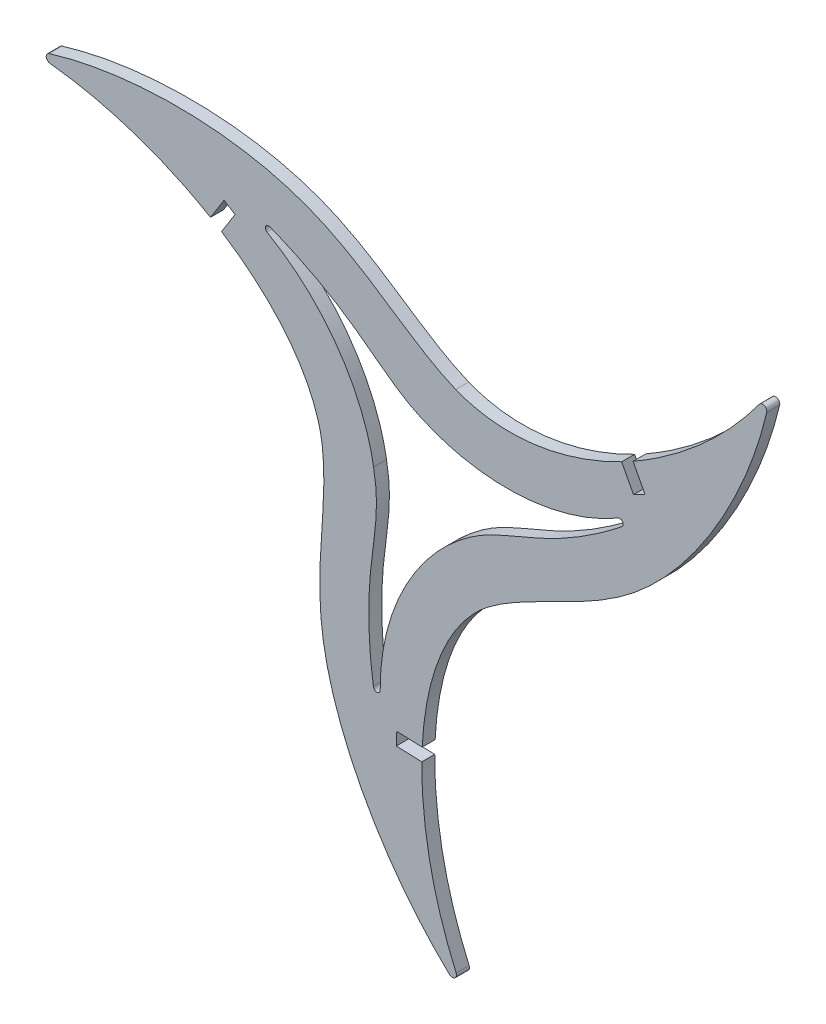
ISO-10303-21;
HEADER;
FILE_DESCRIPTION(('STEP AP214'),'2;1');
FILE_NAME('part.step','',(''),(''),'','','');
FILE_SCHEMA(('AUTOMOTIVE_DESIGN { 1 0 10303 214 1 1 1 1 }'));
ENDSEC;
DATA;
#1=APPLICATION_CONTEXT('core data for automotive mechanical design processes');
#2=APPLICATION_PROTOCOL_DEFINITION('international standard','automotive_design',2000,#1);
#3=PRODUCT_CONTEXT('',#1,'mechanical');
#4=PRODUCT('Part','Part','',(#3));
#5=PRODUCT_RELATED_PRODUCT_CATEGORY('part','',(#4));
#6=PRODUCT_DEFINITION_FORMATION('','',#4);
#7=PRODUCT_DEFINITION_CONTEXT('part definition',#1,'design');
#8=PRODUCT_DEFINITION('design','',#6,#7);
#9=PRODUCT_DEFINITION_SHAPE('','',#8);
#10=(LENGTH_UNIT() NAMED_UNIT(*) SI_UNIT(.MILLI.,.METRE.));
#11=(NAMED_UNIT(*) PLANE_ANGLE_UNIT() SI_UNIT($,.RADIAN.));
#12=(NAMED_UNIT(*) SI_UNIT($,.STERADIAN.) SOLID_ANGLE_UNIT());
#13=UNCERTAINTY_MEASURE_WITH_UNIT(LENGTH_MEASURE(1.E-05),#10,'distance_accuracy_value','');
#14=(GEOMETRIC_REPRESENTATION_CONTEXT(3) GLOBAL_UNCERTAINTY_ASSIGNED_CONTEXT((#13)) GLOBAL_UNIT_ASSIGNED_CONTEXT((#10,
#11,#12)) REPRESENTATION_CONTEXT('',''));
#15=CARTESIAN_POINT('',(0.,0.,0.));
#16=DIRECTION('',(0.,0.,1.));
#17=DIRECTION('',(1.,0.,0.));
#18=AXIS2_PLACEMENT_3D('',#15,#16,#17);
#19=CARTESIAN_POINT('',(-6.52877190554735,-77.4366756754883,1.5875));
#20=DIRECTION('',(0.,0.,-1.));
#21=DIRECTION('',(-1.,0.,0.));
#22=AXIS2_PLACEMENT_3D('',#19,#20,#21);
#23=PLANE('',#22);
#24=DIRECTION('',(0.0387510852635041,0.999248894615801,0.));
#25=VECTOR('',#24,1.);
#26=CARTESIAN_POINT('',(-14.7313340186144,-53.2800894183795,1.5875));
#27=LINE('',#26,#25);
#28=CARTESIAN_POINT('',(-14.8543686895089,-56.45270401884,1.5875));
#29=VERTEX_POINT('',#28);
#30=CARTESIAN_POINT('',(-14.7313340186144,-53.2800894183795,1.5875));
#31=VERTEX_POINT('',#30);
#32=EDGE_CURVE('E479',#29,#31,#27,.T.);
#33=ORIENTED_EDGE('',*,*,#32,.T.);
#34=DIRECTION('',(0.999248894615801,-0.0387510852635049,0.));
#35=VECTOR('',#34,1.);
#36=CARTESIAN_POINT('',(-8.50623298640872,-53.5215001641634,1.5875));
#37=LINE('',#36,#35);
#38=CARTESIAN_POINT('',(-8.50623298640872,-53.5215001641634,1.5875));
#39=VERTEX_POINT('',#38);
#40=EDGE_CURVE('E639',#31,#39,#37,.T.);
#41=ORIENTED_EDGE('',*,*,#40,.T.);
#42=CARTESIAN_POINT('',(-8.50623298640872,-53.5215001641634,1.5875));
#43=CARTESIAN_POINT('',(-7.73523017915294,-37.7848240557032,1.5875));
#44=CARTESIAN_POINT('',(-2.57423755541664,-23.7642628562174,1.5875));
#45=CARTESIAN_POINT('',(7.511092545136,-15.8019659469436,1.5875));
#46=B_SPLINE_CURVE_WITH_KNOTS('',3,(#42,#43,#44,#45),.UNSPECIFIED.,.F.,.F.,(4,4),
(-4.87225398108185,-4.37353785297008),.UNSPECIFIED.);
#47=CARTESIAN_POINT('',(7.511092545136,-15.8019659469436,1.5875));
#48=VERTEX_POINT('',#47);
#49=EDGE_CURVE('E542',#39,#48,#46,.T.);
#50=ORIENTED_EDGE('',*,*,#49,.T.);
#51=CARTESIAN_POINT('',(7.511092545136,-15.8019659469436,1.5875));
#52=CARTESIAN_POINT('',(17.4510254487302,-8.16564504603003,1.5875));
#53=CARTESIAN_POINT('',(47.9124311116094,-0.35037258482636,1.5875));
#54=CARTESIAN_POINT('',(71.0416382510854,38.7823587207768,1.5875));
#55=CARTESIAN_POINT('',(75.951434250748,59.766885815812,1.5875));
#56=B_SPLINE_CURVE_WITH_KNOTS('',3,(#51,#52,#53,#54,#55),.UNSPECIFIED.,.F.,.F.,(4,1,4),
(-9.32417803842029,-7.32774650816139,-4.87225398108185),.UNSPECIFIED.);
#57=CARTESIAN_POINT('',(75.951434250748,59.766885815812,1.5875));
#58=VERTEX_POINT('',#57);
#59=EDGE_CURVE('E560',#48,#58,#56,.T.);
#60=ORIENTED_EDGE('',*,*,#59,.T.);
#61=CARTESIAN_POINT('',(75.951434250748,59.766885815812,1.5875));
#62=CARTESIAN_POINT('',(76.1405251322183,60.5750625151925,1.5875));
#63=CARTESIAN_POINT('',(75.3863139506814,60.9215743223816,1.5875));
#64=(BOUNDED_CURVE() B_SPLINE_CURVE(2,(#61,#62,#63),.UNSPECIFIED.,.F.,
.F.) B_SPLINE_CURVE_WITH_KNOTS((3,3),(0.,0.0547984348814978),
.UNSPECIFIED.) CURVE() GEOMETRIC_REPRESENTATION_ITEM() RATIONAL_B_SPLINE_CURVE((1.,
0.774431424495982,1.)) REPRESENTATION_ITEM(''));
#65=CARTESIAN_POINT('',(75.3863139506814,60.9215743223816,1.5875));
#66=VERTEX_POINT('',#65);
#67=EDGE_CURVE('E557',#58,#66,#64,.T.);
#68=ORIENTED_EDGE('',*,*,#67,.T.);
#69=CARTESIAN_POINT('',(75.3863139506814,60.9215743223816,1.5875));
#70=CARTESIAN_POINT('',(74.632102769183,61.2680861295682,1.5875));
#71=CARTESIAN_POINT('',(74.1420996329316,60.5981593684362,1.5875));
#72=(BOUNDED_CURVE() B_SPLINE_CURVE(2,(#69,#70,#71),.UNSPECIFIED.,.F.,
.F.) B_SPLINE_CURVE_WITH_KNOTS((3,3),(0.,0.0547984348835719),
.UNSPECIFIED.) CURVE() GEOMETRIC_REPRESENTATION_ITEM() RATIONAL_B_SPLINE_CURVE((1.,
0.774431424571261,1.)) REPRESENTATION_ITEM(''));
#73=CARTESIAN_POINT('',(74.1420996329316,60.5981593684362,1.5875));
#74=VERTEX_POINT('',#73);
#75=EDGE_CURVE('E559',#66,#74,#72,.T.);
#76=ORIENTED_EDGE('',*,*,#75,.T.);
#77=CARTESIAN_POINT('',(74.1420996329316,60.5981593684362,1.5875));
#78=CARTESIAN_POINT('',(61.5985868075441,43.5147010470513,1.5875));
#79=CARTESIAN_POINT('',(43.1901504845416,33.0116665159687,1.5875));
#80=(BOUNDED_CURVE() B_SPLINE_CURVE(2,(#77,#78,#79),.UNSPECIFIED.,.F.,
.F.) B_SPLINE_CURVE_WITH_KNOTS((3,3),(0.,1.6443338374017),
.UNSPECIFIED.) CURVE() GEOMETRIC_REPRESENTATION_ITEM() RATIONAL_B_SPLINE_CURVE((1.,
0.978138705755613,1.)) REPRESENTATION_ITEM(''));
#81=CARTESIAN_POINT('',(43.1901504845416,33.0116665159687,1.5875));
#82=VERTEX_POINT('',#81);
#83=EDGE_CURVE('E562',#74,#82,#80,.T.);
#84=ORIENTED_EDGE('',*,*,#83,.T.);
#85=DIRECTION('',(0.466065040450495,-0.884750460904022,0.));
#86=VECTOR('',#85,1.);
#87=CARTESIAN_POINT('',(43.1901504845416,33.0116665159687,1.5875));
#88=LINE('',#87,#86);
#89=CARTESIAN_POINT('',(46.1062979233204,27.4758237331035,1.5875));
#90=VERTEX_POINT('',#89);
#91=EDGE_CURVE('E583',#82,#90,#88,.T.);
#92=ORIENTED_EDGE('',*,*,#91,.T.);
#93=DIRECTION('',(-0.884750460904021,-0.466065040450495,0.));
#94=VECTOR('',#93,1.);
#95=CARTESIAN_POINT('',(43.2972156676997,25.9960674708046,1.5875));
#96=LINE('',#95,#94);
#97=CARTESIAN_POINT('',(43.2972156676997,25.9960674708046,1.5875));
#98=VERTEX_POINT('',#97);
#99=EDGE_CURVE('E588',#90,#98,#96,.T.);
#100=ORIENTED_EDGE('',*,*,#99,.T.);
#101=DIRECTION('',(-0.466065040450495,0.884750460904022,0.));
#102=VECTOR('',#101,1.);
#103=CARTESIAN_POINT('',(40.3937328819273,31.5078684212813,1.5875));
#104=LINE('',#103,#102);
#105=CARTESIAN_POINT('',(40.3937328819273,31.5078684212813,1.5875));
#106=VERTEX_POINT('',#105);
#107=EDGE_CURVE('E590',#98,#106,#104,.T.);
#108=ORIENTED_EDGE('',*,*,#107,.T.);
#109=CARTESIAN_POINT('',(40.3937328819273,31.5078684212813,1.5875));
#110=CARTESIAN_POINT('',(26.3798701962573,24.3072383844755,1.5875));
#111=CARTESIAN_POINT('',(11.65721170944,21.7665085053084,1.5875));
#112=CARTESIAN_POINT('',(-0.281004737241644,26.5195121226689,1.5875));
#113=B_SPLINE_CURVE_WITH_KNOTS('',3,(#109,#110,#111,#112),.UNSPECIFIED.,.F.,.F.,(4,4),
(-10.9676672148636,-10.4689510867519),.UNSPECIFIED.);
#114=CARTESIAN_POINT('',(-0.281004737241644,26.5195121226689,1.5875));
#115=VERTEX_POINT('',#114);
#116=EDGE_CURVE('E592',#106,#115,#113,.T.);
#117=ORIENTED_EDGE('',*,*,#116,.T.);
#118=CARTESIAN_POINT('',(-0.281004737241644,26.5195121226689,1.5875));
#119=CARTESIAN_POINT('',(-11.8642190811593,31.3095860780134,1.5875));
#120=CARTESIAN_POINT('',(-33.8631464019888,53.782300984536,1.5875));
#121=CARTESIAN_POINT('',(-79.3176894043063,54.2464162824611,1.5875));
#122=CARTESIAN_POINT('',(-99.9457209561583,48.0061607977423,1.5875));
#123=B_SPLINE_CURVE_WITH_KNOTS('',3,(#118,#119,#120,#121,#122),.UNSPECIFIED.,.F.,.F.,(4,1,4),
(-15.4195912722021,-13.4231597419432,-10.9676672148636),.UNSPECIFIED.);
#124=CARTESIAN_POINT('',(-99.9457209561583,48.0061607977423,1.5875));
#125=VERTEX_POINT('',#124);
#126=EDGE_CURVE('E597',#115,#125,#123,.T.);
#127=ORIENTED_EDGE('',*,*,#126,.T.);
#128=CARTESIAN_POINT('',(-99.9457209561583,48.0061607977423,1.5875));
#129=CARTESIAN_POINT('',(-100.740167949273,47.765829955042,1.5875));
#130=CARTESIAN_POINT('',(-100.663150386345,46.9394080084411,1.5875));
#131=(BOUNDED_CURVE() B_SPLINE_CURVE(2,(#128,#129,#130),.UNSPECIFIED.,.F.,
.F.) B_SPLINE_CURVE_WITH_KNOTS((3,3),(0.,0.0547984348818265),
.UNSPECIFIED.) CURVE() GEOMETRIC_REPRESENTATION_ITEM() RATIONAL_B_SPLINE_CURVE((1.,
0.774431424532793,1.)) REPRESENTATION_ITEM(''));
#132=CARTESIAN_POINT('',(-100.663150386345,46.9394080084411,1.5875));
#133=VERTEX_POINT('',#132);
#134=EDGE_CURVE('E1063',#125,#133,#131,.T.);
#135=ORIENTED_EDGE('',*,*,#134,.T.);
#136=CARTESIAN_POINT('',(-100.663150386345,46.9394080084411,1.5875));
#137=CARTESIAN_POINT('',(-100.586132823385,46.1129860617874,1.5875));
#138=CARTESIAN_POINT('',(-99.7609576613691,46.0235942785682,1.5875));
#139=(BOUNDED_CURVE() B_SPLINE_CURVE(2,(#136,#137,#138),.UNSPECIFIED.,.F.,
.F.) B_SPLINE_CURVE_WITH_KNOTS((3,3),(0.,0.0547984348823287),
.UNSPECIFIED.) CURVE() GEOMETRIC_REPRESENTATION_ITEM() RATIONAL_B_SPLINE_CURVE((1.,
0.774431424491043,1.)) REPRESENTATION_ITEM(''));
#140=CARTESIAN_POINT('',(-99.7609576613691,46.0235942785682,1.5875));
#141=VERTEX_POINT('',#140);
#142=EDGE_CURVE('E1080',#133,#141,#139,.T.);
#143=ORIENTED_EDGE('',*,*,#142,.T.);
#144=CARTESIAN_POINT('',(-99.7609576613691,46.0235942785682,1.5875));
#145=CARTESIAN_POINT('',(-78.6944923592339,43.7023226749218,1.5875));
#146=CARTESIAN_POINT('',(-60.3943794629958,33.0116664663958,1.5875));
#147=(BOUNDED_CURVE() B_SPLINE_CURVE(2,(#144,#145,#146),.UNSPECIFIED.,.F.,
.F.) B_SPLINE_CURVE_WITH_KNOTS((3,3),(0.,1.64433383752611),
.UNSPECIFIED.) CURVE() GEOMETRIC_REPRESENTATION_ITEM() RATIONAL_B_SPLINE_CURVE((1.,
0.978138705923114,1.)) REPRESENTATION_ITEM(''));
#148=CARTESIAN_POINT('',(-60.3943794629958,33.0116664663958,1.5875));
#149=VERTEX_POINT('',#148);
#150=EDGE_CURVE('E1055',#141,#149,#147,.T.);
#151=ORIENTED_EDGE('',*,*,#150,.T.);
#152=DIRECTION('',(0.53318384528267,0.845999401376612,0.));
#153=VECTOR('',#152,1.);
#154=CARTESIAN_POINT('',(-60.3943794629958,33.0116664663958,1.5875));
#155=LINE('',#154,#153);
#156=CARTESIAN_POINT('',(-57.0582727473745,38.3050456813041,1.5875));
#157=VERTEX_POINT('',#156);
#158=EDGE_CURVE('E1052',#149,#157,#155,.T.);
#159=ORIENTED_EDGE('',*,*,#158,.T.);
#160=DIRECTION('',(0.845999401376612,-0.533183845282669,0.));
#161=VECTOR('',#160,1.);
#162=CARTESIAN_POINT('',(-57.0582727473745,38.3050456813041,1.5875));
#163=LINE('',#162,#161);
#164=CARTESIAN_POINT('',(-54.3722251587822,36.6121872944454,1.5875));
#165=VERTEX_POINT('',#164);
#166=EDGE_CURVE('E1050',#157,#165,#163,.T.);
#167=ORIENTED_EDGE('',*,*,#166,.T.);
#168=DIRECTION('',(-0.533183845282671,-0.845999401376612,0.));
#169=VECTOR('',#168,1.);
#170=CARTESIAN_POINT('',(-57.6938433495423,31.3417969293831,1.5875));
#171=LINE('',#170,#169);
#172=CARTESIAN_POINT('',(-57.6938433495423,31.3417969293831,1.5875));
#173=VERTEX_POINT('',#172);
#174=EDGE_CURVE('E1042',#165,#173,#171,.T.);
#175=ORIENTED_EDGE('',*,*,#174,.T.);
#176=CARTESIAN_POINT('',(-57.6938433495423,31.3417969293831,1.5875));
#177=CARTESIAN_POINT('',(-44.4509834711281,22.8057508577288,1.5875));
#178=CARTESIAN_POINT('',(-34.8893176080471,11.3259195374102,1.5875));
#179=CARTESIAN_POINT('',(-33.0364312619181,-1.38938098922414,1.5875));
#180=B_SPLINE_CURVE_WITH_KNOTS('',3,(#176,#177,#178,#179),.UNSPECIFIED.,.F.,.F.,(4,4),
(-17.0630804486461,-16.5643643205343),.UNSPECIFIED.);
#181=CARTESIAN_POINT('',(-33.0364312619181,-1.38938098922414,1.5875));
#182=VERTEX_POINT('',#181);
#183=EDGE_CURVE('E325',#173,#182,#180,.T.);
#184=ORIENTED_EDGE('',*,*,#183,.T.);
#185=CARTESIAN_POINT('',(-33.0364312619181,-1.38938098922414,1.5875));
#186=CARTESIAN_POINT('',(-31.3931498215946,-13.8157758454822,1.5875));
#187=CARTESIAN_POINT('',(-39.8556281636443,-44.1037632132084,1.5875));
#188=CARTESIAN_POINT('',(-17.5302923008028,-83.7006098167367,1.5875));
#189=CARTESIAN_POINT('',(-1.81205674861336,-98.4448814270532,1.5875));
#190=B_SPLINE_CURVE_WITH_KNOTS('',3,(#185,#186,#187,#188,#189),.UNSPECIFIED.,.F.,.F.,(4,1,4),
(-21.5150045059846,-19.5185729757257,-17.0630804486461),.UNSPECIFIED.);
#191=CARTESIAN_POINT('',(-1.81205674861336,-98.4448814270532,1.5875));
#192=VERTEX_POINT('',#191);
#193=EDGE_CURVE('E319',#182,#192,#190,.T.);
#194=ORIENTED_EDGE('',*,*,#193,.T.);
#195=CARTESIAN_POINT('',(-1.81205674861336,-98.4448814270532,1.5875));
#196=CARTESIAN_POINT('',(-1.20670063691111,-99.0127272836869,1.5875));
#197=CARTESIAN_POINT('',(-0.529507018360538,-98.5328171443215,1.5875));
#198=(BOUNDED_CURVE() B_SPLINE_CURVE(2,(#195,#196,#197),.UNSPECIFIED.,.F.,
.F.) B_SPLINE_CURVE_WITH_KNOTS((3,3),(0.,0.0547984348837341),
.UNSPECIFIED.) CURVE() GEOMETRIC_REPRESENTATION_ITEM() RATIONAL_B_SPLINE_CURVE((1.,
0.774431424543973,1.)) REPRESENTATION_ITEM(''));
#199=CARTESIAN_POINT('',(-0.529507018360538,-98.5328171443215,1.5875));
#200=VERTEX_POINT('',#199);
#201=EDGE_CURVE('E324',#192,#200,#198,.T.);
#202=ORIENTED_EDGE('',*,*,#201,.T.);
#203=CARTESIAN_POINT('',(-0.529507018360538,-98.5328171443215,1.5875));
#204=CARTESIAN_POINT('',(0.147686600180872,-98.0529070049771,1.5875));
#205=CARTESIAN_POINT('',(-0.187485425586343,-97.2935884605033,1.5875));
#206=(BOUNDED_CURVE() B_SPLINE_CURVE(2,(#203,#204,#205),.UNSPECIFIED.,.F.,
.F.) B_SPLINE_CURVE_WITH_KNOTS((3,3),(0.,0.0547984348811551),
.UNSPECIFIED.) CURVE() GEOMETRIC_REPRESENTATION_ITEM() RATIONAL_B_SPLINE_CURVE((1.,
0.77443142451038,1.)) REPRESENTATION_ITEM(''));
#207=CARTESIAN_POINT('',(-0.187485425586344,-97.2935884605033,1.5875));
#208=VERTEX_POINT('',#207);
#209=EDGE_CURVE('E336',#200,#208,#206,.T.);
#210=ORIENTED_EDGE('',*,*,#209,.T.);
#211=CARTESIAN_POINT('',(-0.187485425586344,-97.2935884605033,1.5875));
#212=CARTESIAN_POINT('',(-8.71043790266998,-77.8888585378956,1.5875));
#213=CARTESIAN_POINT('',(-8.60211447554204,-56.6951677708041,1.5875));
#214=(BOUNDED_CURVE() B_SPLINE_CURVE(2,(#211,#212,#213),.UNSPECIFIED.,.F.,
.F.) B_SPLINE_CURVE_WITH_KNOTS((3,3),(0.,1.64433383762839),
.UNSPECIFIED.) CURVE() GEOMETRIC_REPRESENTATION_ITEM() RATIONAL_B_SPLINE_CURVE((1.,
0.978138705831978,1.)) REPRESENTATION_ITEM(''));
#215=CARTESIAN_POINT('',(-8.60211447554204,-56.6951677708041,1.5875));
#216=VERTEX_POINT('',#215);
#217=EDGE_CURVE('E343',#208,#216,#214,.T.);
#218=ORIENTED_EDGE('',*,*,#217,.T.);
#219=DIRECTION('',(-0.999248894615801,0.0387510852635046,0.));
#220=VECTOR('',#219,1.);
#221=CARTESIAN_POINT('',(-8.60211447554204,-56.6951677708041,1.5875));
#222=LINE('',#221,#220);
#223=EDGE_CURVE('E350',#216,#29,#222,.T.);
#224=ORIENTED_EDGE('',*,*,#223,.T.);
#225=EDGE_LOOP('',(#33,#41,#50,#60,#68,#76,#84,#92,#100,#108,#117,#127,#135,#143,#151,#159,#167,
#175,#184,#194,#202,#210,#218,#224));
#226=FACE_BOUND('',#225,.T.);
#227=CARTESIAN_POINT('',(39.5662535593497,19.140152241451,1.5875));
#228=CARTESIAN_POINT('',(31.4491730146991,14.4156186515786,1.5875));
#229=CARTESIAN_POINT('',(14.5864923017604,10.2111099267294,1.5875));
#230=CARTESIAN_POINT('',(0.388470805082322,12.7486333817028,1.5875));
#231=CARTESIAN_POINT('',(-5.38561901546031,14.899299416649,1.5875));
#232=B_SPLINE_CURVE_WITH_KNOTS('',3,(#227,#228,#229,#230,#231),.UNSPECIFIED.,.F.,.F.,(4,1,4),
(6.03674102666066,6.50552735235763,6.97431367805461),.UNSPECIFIED.);
#233=CARTESIAN_POINT('',(39.5662535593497,19.140152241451,1.5875));
#234=VERTEX_POINT('',#233);
#235=CARTESIAN_POINT('',(-5.38561901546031,14.899299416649,1.5875));
#236=VERTEX_POINT('',#235);
#237=EDGE_CURVE('E246',#234,#236,#232,.T.);
#238=ORIENTED_EDGE('',*,*,#237,.F.);
#239=CARTESIAN_POINT('',(40.3442140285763,17.6671163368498,1.5875));
#240=CARTESIAN_POINT('',(40.5017514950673,17.7911972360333,1.5875));
#241=CARTESIAN_POINT('',(41.3286632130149,18.4429762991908,1.5875));
#242=CARTESIAN_POINT('',(40.8017205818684,19.5873427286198,1.5875));
#243=CARTESIAN_POINT('',(39.7004339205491,19.218251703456,1.5875));
#244=CARTESIAN_POINT('',(39.5662535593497,19.140152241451,1.5875));
#245=B_SPLINE_CURVE_WITH_KNOTS('',5,(#239,#240,#241,#242,#243,#244),.UNSPECIFIED.,.F.,.F.,(6,6),
(5.03674102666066,6.03674102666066),.UNSPECIFIED.);
#246=CARTESIAN_POINT('',(40.3442140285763,17.6671163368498,1.5875));
#247=VERTEX_POINT('',#246);
#248=EDGE_CURVE('E659',#247,#234,#245,.T.);
#249=ORIENTED_EDGE('',*,*,#248,.F.);
#250=CARTESIAN_POINT('',(0.,-5.5711336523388,1.5875));
#251=CARTESIAN_POINT('',(0.820505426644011,-4.90757564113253,1.5875));
#252=CARTESIAN_POINT('',(11.4383852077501,3.76167451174,1.5875));
#253=CARTESIAN_POINT('',(21.5554192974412,2.86853796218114,1.5875));
#254=CARTESIAN_POINT('',(40.3442140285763,17.6671163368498,1.5875));
#255=B_SPLINE_CURVE_WITH_KNOTS('',3,(#250,#251,#252,#253,#254),.UNSPECIFIED.,.F.,.F.,(4,1,4),
(3.95594316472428,4.03674102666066,5.03674102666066),.UNSPECIFIED.);
#256=CARTESIAN_POINT('',(0.,-5.5711336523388,1.5875));
#257=VERTEX_POINT('',#256);
#258=EDGE_CURVE('E731',#257,#247,#255,.T.);
#259=ORIENTED_EDGE('',*,*,#258,.F.);
#260=CARTESIAN_POINT('',(-18.8032500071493,-46.6210236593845,1.5875));
#261=CARTESIAN_POINT('',(-18.8362758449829,-37.229158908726,1.5875));
#262=CARTESIAN_POINT('',(-14.0461468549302,-20.5233946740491,1.5875));
#263=CARTESIAN_POINT('',(-4.74957633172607,-9.49630910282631,1.5875));
#264=CARTESIAN_POINT('',(0.,-5.5711336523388,1.5875));
#265=B_SPLINE_CURVE_WITH_KNOTS('',3,(#260,#261,#262,#263,#264),.UNSPECIFIED.,.F.,.F.,(4,1,4),
(3.01837051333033,3.4871568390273,3.95594316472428),.UNSPECIFIED.);
#266=CARTESIAN_POINT('',(-18.8032500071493,-46.6210236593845,1.5875));
#267=VERTEX_POINT('',#266);
#268=EDGE_CURVE('E754',#267,#257,#265,.T.);
#269=ORIENTED_EDGE('',*,*,#268,.F.);
#270=CARTESIAN_POINT('',(-20.4679167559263,-46.5582392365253,1.5875));
#271=CARTESIAN_POINT('',(-20.4392282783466,-46.7567111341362,1.5875));
#272=CARTESIAN_POINT('',(-20.2882269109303,-47.7987272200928,1.5875));
#273=CARTESIAN_POINT('',(-19.0337051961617,-47.9145647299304,1.5875));
#274=CARTESIAN_POINT('',(-18.8027040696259,-46.7762769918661,1.5875));
#275=CARTESIAN_POINT('',(-18.8032500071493,-46.6210236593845,1.5875));
#276=B_SPLINE_CURVE_WITH_KNOTS('',5,(#270,#271,#272,#273,#274,#275),.UNSPECIFIED.,.F.,.F.,(6,6),
(2.01837051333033,3.01837051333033),.UNSPECIFIED.);
#277=CARTESIAN_POINT('',(-20.4679167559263,-46.5582392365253,1.5875));
#278=VERTEX_POINT('',#277);
#279=EDGE_CURVE('E758',#278,#267,#276,.T.);
#280=ORIENTED_EDGE('',*,*,#279,.F.);
#281=CARTESIAN_POINT('',(-20.4207245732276,0.,1.5875));
#282=CARTESIAN_POINT('',(-20.2563191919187,-1.04235754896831,1.5875));
#283=CARTESIAN_POINT('',(-18.0574682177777,-14.5723362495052,1.5875));
#284=CARTESIAN_POINT('',(-23.8894642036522,-22.8873765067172,1.5875));
#285=CARTESIAN_POINT('',(-20.4679167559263,-46.5582392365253,1.5875));
#286=B_SPLINE_CURVE_WITH_KNOTS('',3,(#281,#282,#283,#284,#285),.UNSPECIFIED.,.F.,.F.,(4,1,4),
(0.93757265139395,1.01837051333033,2.01837051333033),.UNSPECIFIED.);
#287=CARTESIAN_POINT('',(-20.4207245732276,0.,1.5875));
#288=VERTEX_POINT('',#287);
#289=EDGE_CURVE('E766',#288,#278,#286,.T.);
#290=ORIENTED_EDGE('',*,*,#289,.F.);
#291=CARTESIAN_POINT('',(-46.5693471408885,36.8090371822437,1.5875));
#292=CARTESIAN_POINT('',(-38.4192407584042,32.1417060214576,1.5875));
#293=CARTESIAN_POINT('',(-26.3466890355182,19.6404505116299,1.5875));
#294=CARTESIAN_POINT('',(-21.4452380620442,6.07584148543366,1.5875));
#295=CARTESIAN_POINT('',(-20.4207245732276,0.,1.5875));
#296=B_SPLINE_CURVE_WITH_KNOTS('',3,(#291,#292,#293,#294,#295),.UNSPECIFIED.,.F.,.F.,(4,1,4),
(0.,0.468786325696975,0.93757265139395),.UNSPECIFIED.);
#297=CARTESIAN_POINT('',(-46.5693471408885,36.8090371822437,1.5875));
#298=VERTEX_POINT('',#297);
#299=EDGE_CURVE('E269',#298,#288,#296,.T.);
#300=ORIENTED_EDGE('',*,*,#299,.F.);
#301=CARTESIAN_POINT('',(-45.682640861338,38.2192886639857,1.5875));
#302=CARTESIAN_POINT('',(-45.8688668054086,38.2936796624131,1.5875));
#303=CARTESIAN_POINT('',(-46.8467798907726,38.6839166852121,1.5875));
#304=CARTESIAN_POINT('',(-47.5743589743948,37.6553877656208,1.5875));
#305=CARTESIAN_POINT('',(-46.7040734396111,36.8861910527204,1.5875));
#306=CARTESIAN_POINT('',(-46.5693471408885,36.8090371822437,1.5875));
#307=B_SPLINE_CURVE_WITH_KNOTS('',5,(#301,#302,#303,#304,#305,#306),.UNSPECIFIED.,.F.,.F.,(6,6),
(-1.,0.),.UNSPECIFIED.);
#308=CARTESIAN_POINT('',(-45.682640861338,38.2192886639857,1.5875));
#309=VERTEX_POINT('',#308);
#310=EDGE_CURVE('E267',#309,#298,#307,.T.);
#311=ORIENTED_EDGE('',*,*,#310,.F.);
#312=CARTESIAN_POINT('',(-5.38561901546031,14.899299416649,1.5875));
#313=CARTESIAN_POINT('',(-6.37052982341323,15.2780989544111,1.5875));
#314=CARTESIAN_POINT('',(-19.1872605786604,20.1388275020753,1.5875));
#315=CARTESIAN_POINT('',(-23.4722986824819,29.3470043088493,1.5875));
#316=CARTESIAN_POINT('',(-45.682640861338,38.2192886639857,1.5875));
#317=B_SPLINE_CURVE_WITH_KNOTS('',3,(#312,#313,#314,#315,#316),.UNSPECIFIED.,.F.,.F.,(4,1,4),
(6.97431367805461,7.05511153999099,8.05511153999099),.UNSPECIFIED.);
#318=EDGE_CURVE('E254',#236,#309,#317,.T.);
#319=ORIENTED_EDGE('',*,*,#318,.F.);
#320=EDGE_LOOP('',(#238,#249,#259,#269,#280,#290,#300,#311,#319));
#321=FACE_BOUND('',#320,.T.);
#322=ADVANCED_FACE('F31',(#226,#321),#23,.F.);
#323=CARTESIAN_POINT('',(-6.52877190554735,-77.4366756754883,-1.5875));
#324=DIRECTION('',(0.,0.,-1.));
#325=DIRECTION('',(-1.,0.,0.));
#326=AXIS2_PLACEMENT_3D('',#323,#324,#325);
#327=PLANE('',#326);
#328=DIRECTION('',(0.0387510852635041,0.999248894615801,0.));
#329=VECTOR('',#328,1.);
#330=CARTESIAN_POINT('',(-14.7313340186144,-53.2800894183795,-1.5875));
#331=LINE('',#330,#329);
#332=CARTESIAN_POINT('',(-14.8543686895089,-56.45270401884,-1.5875));
#333=VERTEX_POINT('',#332);
#334=CARTESIAN_POINT('',(-14.7313340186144,-53.2800894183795,-1.5875));
#335=VERTEX_POINT('',#334);
#336=EDGE_CURVE('E262',#333,#335,#331,.T.);
#337=ORIENTED_EDGE('',*,*,#336,.F.);
#338=DIRECTION('',(-0.999248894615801,0.0387510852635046,0.));
#339=VECTOR('',#338,1.);
#340=CARTESIAN_POINT('',(-8.60211447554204,-56.6951677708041,-1.5875));
#341=LINE('',#340,#339);
#342=CARTESIAN_POINT('',(-8.60211447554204,-56.6951677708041,-1.5875));
#343=VERTEX_POINT('',#342);
#344=EDGE_CURVE('E474',#343,#333,#341,.T.);
#345=ORIENTED_EDGE('',*,*,#344,.F.);
#346=CARTESIAN_POINT('',(-0.187485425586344,-97.2935884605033,-1.5875));
#347=CARTESIAN_POINT('',(-8.71043790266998,-77.8888585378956,-1.5875));
#348=CARTESIAN_POINT('',(-8.60211447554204,-56.6951677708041,-1.5875));
#349=(BOUNDED_CURVE() B_SPLINE_CURVE(2,(#346,#347,#348),.UNSPECIFIED.,.F.,
.F.) B_SPLINE_CURVE_WITH_KNOTS((3,3),(0.,1.64433383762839),
.UNSPECIFIED.) CURVE() GEOMETRIC_REPRESENTATION_ITEM() RATIONAL_B_SPLINE_CURVE((1.,
0.978138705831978,1.)) REPRESENTATION_ITEM(''));
#350=CARTESIAN_POINT('',(-0.187485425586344,-97.2935884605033,-1.5875));
#351=VERTEX_POINT('',#350);
#352=EDGE_CURVE('E467',#351,#343,#349,.T.);
#353=ORIENTED_EDGE('',*,*,#352,.F.);
#354=CARTESIAN_POINT('',(-0.529507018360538,-98.5328171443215,-1.5875));
#355=CARTESIAN_POINT('',(0.147686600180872,-98.0529070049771,-1.5875));
#356=CARTESIAN_POINT('',(-0.187485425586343,-97.2935884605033,-1.5875));
#357=(BOUNDED_CURVE() B_SPLINE_CURVE(2,(#354,#355,#356),.UNSPECIFIED.,.F.,
.F.) B_SPLINE_CURVE_WITH_KNOTS((3,3),(0.,0.0547984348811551),
.UNSPECIFIED.) CURVE() GEOMETRIC_REPRESENTATION_ITEM() RATIONAL_B_SPLINE_CURVE((1.,
0.77443142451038,1.)) REPRESENTATION_ITEM(''));
#358=CARTESIAN_POINT('',(-0.529507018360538,-98.5328171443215,-1.5875));
#359=VERTEX_POINT('',#358);
#360=EDGE_CURVE('E460',#359,#351,#357,.T.);
#361=ORIENTED_EDGE('',*,*,#360,.F.);
#362=CARTESIAN_POINT('',(-1.81205674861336,-98.4448814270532,-1.5875));
#363=CARTESIAN_POINT('',(-1.20670063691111,-99.0127272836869,-1.5875));
#364=CARTESIAN_POINT('',(-0.529507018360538,-98.5328171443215,-1.5875));
#365=(BOUNDED_CURVE() B_SPLINE_CURVE(2,(#362,#363,#364),.UNSPECIFIED.,.F.,
.F.) B_SPLINE_CURVE_WITH_KNOTS((3,3),(0.,0.0547984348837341),
.UNSPECIFIED.) CURVE() GEOMETRIC_REPRESENTATION_ITEM() RATIONAL_B_SPLINE_CURVE((1.,
0.774431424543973,1.)) REPRESENTATION_ITEM(''));
#366=CARTESIAN_POINT('',(-1.81205674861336,-98.4448814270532,-1.5875));
#367=VERTEX_POINT('',#366);
#368=EDGE_CURVE('E453',#367,#359,#365,.T.);
#369=ORIENTED_EDGE('',*,*,#368,.F.);
#370=CARTESIAN_POINT('',(-33.0364312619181,-1.38938098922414,-1.5875));
#371=CARTESIAN_POINT('',(-31.3931498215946,-13.8157758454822,-1.5875));
#372=CARTESIAN_POINT('',(-39.8556281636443,-44.1037632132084,-1.5875));
#373=CARTESIAN_POINT('',(-17.5302923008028,-83.7006098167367,-1.5875));
#374=CARTESIAN_POINT('',(-1.81205674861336,-98.4448814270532,-1.5875));
#375=B_SPLINE_CURVE_WITH_KNOTS('',3,(#370,#371,#372,#373,#374),.UNSPECIFIED.,.F.,.F.,(4,1,4),
(-21.5150045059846,-19.5185729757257,-17.0630804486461),.UNSPECIFIED.);
#376=CARTESIAN_POINT('',(-33.0364312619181,-1.38938098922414,-1.5875));
#377=VERTEX_POINT('',#376);
#378=EDGE_CURVE('E446',#377,#367,#375,.T.);
#379=ORIENTED_EDGE('',*,*,#378,.F.);
#380=CARTESIAN_POINT('',(-57.6938433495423,31.3417969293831,-1.5875));
#381=CARTESIAN_POINT('',(-44.4509834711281,22.8057508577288,-1.5875));
#382=CARTESIAN_POINT('',(-34.8893176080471,11.3259195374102,-1.5875));
#383=CARTESIAN_POINT('',(-33.0364312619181,-1.38938098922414,-1.5875));
#384=B_SPLINE_CURVE_WITH_KNOTS('',3,(#380,#381,#382,#383),.UNSPECIFIED.,.F.,.F.,(4,4),
(-17.0630804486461,-16.5643643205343),.UNSPECIFIED.);
#385=CARTESIAN_POINT('',(-57.6938433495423,31.3417969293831,-1.5875));
#386=VERTEX_POINT('',#385);
#387=EDGE_CURVE('E442',#386,#377,#384,.T.);
#388=ORIENTED_EDGE('',*,*,#387,.F.);
#389=DIRECTION('',(-0.533183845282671,-0.845999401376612,0.));
#390=VECTOR('',#389,1.);
#391=CARTESIAN_POINT('',(-57.6938433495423,31.3417969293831,-1.5875));
#392=LINE('',#391,#390);
#393=CARTESIAN_POINT('',(-54.3722251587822,36.6121872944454,-1.5875));
#394=VERTEX_POINT('',#393);
#395=EDGE_CURVE('E440',#394,#386,#392,.T.);
#396=ORIENTED_EDGE('',*,*,#395,.F.);
#397=DIRECTION('',(0.845999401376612,-0.533183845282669,0.));
#398=VECTOR('',#397,1.);
#399=CARTESIAN_POINT('',(-57.0582727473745,38.3050456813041,-1.5875));
#400=LINE('',#399,#398);
#401=CARTESIAN_POINT('',(-57.0582727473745,38.3050456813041,-1.5875));
#402=VERTEX_POINT('',#401);
#403=EDGE_CURVE('E438',#402,#394,#400,.T.);
#404=ORIENTED_EDGE('',*,*,#403,.F.);
#405=DIRECTION('',(0.53318384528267,0.845999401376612,0.));
#406=VECTOR('',#405,1.);
#407=CARTESIAN_POINT('',(-60.3943794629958,33.0116664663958,-1.5875));
#408=LINE('',#407,#406);
#409=CARTESIAN_POINT('',(-60.3943794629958,33.0116664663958,-1.5875));
#410=VERTEX_POINT('',#409);
#411=EDGE_CURVE('E433',#410,#402,#408,.T.);
#412=ORIENTED_EDGE('',*,*,#411,.F.);
#413=CARTESIAN_POINT('',(-99.7609576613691,46.0235942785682,-1.5875));
#414=CARTESIAN_POINT('',(-78.6944923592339,43.7023226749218,-1.5875));
#415=CARTESIAN_POINT('',(-60.3943794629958,33.0116664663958,-1.5875));
#416=(BOUNDED_CURVE() B_SPLINE_CURVE(2,(#413,#414,#415),.UNSPECIFIED.,.F.,
.F.) B_SPLINE_CURVE_WITH_KNOTS((3,3),(0.,1.64433383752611),
.UNSPECIFIED.) CURVE() GEOMETRIC_REPRESENTATION_ITEM() RATIONAL_B_SPLINE_CURVE((1.,
0.978138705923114,1.)) REPRESENTATION_ITEM(''));
#417=CARTESIAN_POINT('',(-99.7609576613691,46.0235942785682,-1.5875));
#418=VERTEX_POINT('',#417);
#419=EDGE_CURVE('E426',#418,#410,#416,.T.);
#420=ORIENTED_EDGE('',*,*,#419,.F.);
#421=CARTESIAN_POINT('',(-100.663150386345,46.9394080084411,-1.5875));
#422=CARTESIAN_POINT('',(-100.586132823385,46.1129860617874,-1.5875));
#423=CARTESIAN_POINT('',(-99.7609576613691,46.0235942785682,-1.5875));
#424=(BOUNDED_CURVE() B_SPLINE_CURVE(2,(#421,#422,#423),.UNSPECIFIED.,.F.,
.F.) B_SPLINE_CURVE_WITH_KNOTS((3,3),(0.,0.0547984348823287),
.UNSPECIFIED.) CURVE() GEOMETRIC_REPRESENTATION_ITEM() RATIONAL_B_SPLINE_CURVE((1.,
0.774431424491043,1.)) REPRESENTATION_ITEM(''));
#425=CARTESIAN_POINT('',(-100.663150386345,46.9394080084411,-1.5875));
#426=VERTEX_POINT('',#425);
#427=EDGE_CURVE('E419',#426,#418,#424,.T.);
#428=ORIENTED_EDGE('',*,*,#427,.F.);
#429=CARTESIAN_POINT('',(-99.9457209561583,48.0061607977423,-1.5875));
#430=CARTESIAN_POINT('',(-100.740167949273,47.765829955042,-1.5875));
#431=CARTESIAN_POINT('',(-100.663150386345,46.9394080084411,-1.5875));
#432=(BOUNDED_CURVE() B_SPLINE_CURVE(2,(#429,#430,#431),.UNSPECIFIED.,.F.,
.F.) B_SPLINE_CURVE_WITH_KNOTS((3,3),(0.,0.0547984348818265),
.UNSPECIFIED.) CURVE() GEOMETRIC_REPRESENTATION_ITEM() RATIONAL_B_SPLINE_CURVE((1.,
0.774431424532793,1.)) REPRESENTATION_ITEM(''));
#433=CARTESIAN_POINT('',(-99.9457209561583,48.0061607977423,-1.5875));
#434=VERTEX_POINT('',#433);
#435=EDGE_CURVE('E412',#434,#426,#432,.T.);
#436=ORIENTED_EDGE('',*,*,#435,.F.);
#437=CARTESIAN_POINT('',(-0.281004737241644,26.5195121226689,-1.5875));
#438=CARTESIAN_POINT('',(-11.8642190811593,31.3095860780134,-1.5875));
#439=CARTESIAN_POINT('',(-33.8631464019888,53.782300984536,-1.5875));
#440=CARTESIAN_POINT('',(-79.3176894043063,54.2464162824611,-1.5875));
#441=CARTESIAN_POINT('',(-99.9457209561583,48.0061607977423,-1.5875));
#442=B_SPLINE_CURVE_WITH_KNOTS('',3,(#437,#438,#439,#440,#441),.UNSPECIFIED.,.F.,.F.,(4,1,4),
(-15.4195912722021,-13.4231597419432,-10.9676672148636),.UNSPECIFIED.);
#443=CARTESIAN_POINT('',(-0.281004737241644,26.5195121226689,-1.5875));
#444=VERTEX_POINT('',#443);
#445=EDGE_CURVE('E405',#444,#434,#442,.T.);
#446=ORIENTED_EDGE('',*,*,#445,.F.);
#447=CARTESIAN_POINT('',(40.3937328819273,31.5078684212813,-1.5875));
#448=CARTESIAN_POINT('',(26.3798701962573,24.3072383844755,-1.5875));
#449=CARTESIAN_POINT('',(11.65721170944,21.7665085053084,-1.5875));
#450=CARTESIAN_POINT('',(-0.281004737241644,26.5195121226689,-1.5875));
#451=B_SPLINE_CURVE_WITH_KNOTS('',3,(#447,#448,#449,#450),.UNSPECIFIED.,.F.,.F.,(4,4),
(-10.9676672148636,-10.4689510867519),.UNSPECIFIED.);
#452=CARTESIAN_POINT('',(40.3937328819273,31.5078684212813,-1.5875));
#453=VERTEX_POINT('',#452);
#454=EDGE_CURVE('E401',#453,#444,#451,.T.);
#455=ORIENTED_EDGE('',*,*,#454,.F.);
#456=DIRECTION('',(-0.466065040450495,0.884750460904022,0.));
#457=VECTOR('',#456,1.);
#458=CARTESIAN_POINT('',(40.3937328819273,31.5078684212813,-1.5875));
#459=LINE('',#458,#457);
#460=CARTESIAN_POINT('',(43.2972156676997,25.9960674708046,-1.5875));
#461=VERTEX_POINT('',#460);
#462=EDGE_CURVE('E399',#461,#453,#459,.T.);
#463=ORIENTED_EDGE('',*,*,#462,.F.);
#464=DIRECTION('',(-0.884750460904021,-0.466065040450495,0.));
#465=VECTOR('',#464,1.);
#466=CARTESIAN_POINT('',(43.2972156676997,25.9960674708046,-1.5875));
#467=LINE('',#466,#465);
#468=CARTESIAN_POINT('',(46.1062979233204,27.4758237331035,-1.5875));
#469=VERTEX_POINT('',#468);
#470=EDGE_CURVE('E397',#469,#461,#467,.T.);
#471=ORIENTED_EDGE('',*,*,#470,.F.);
#472=DIRECTION('',(0.466065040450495,-0.884750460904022,0.));
#473=VECTOR('',#472,1.);
#474=CARTESIAN_POINT('',(43.1901504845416,33.0116665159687,-1.5875));
#475=LINE('',#474,#473);
#476=CARTESIAN_POINT('',(43.1901504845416,33.0116665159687,-1.5875));
#477=VERTEX_POINT('',#476);
#478=EDGE_CURVE('E392',#477,#469,#475,.T.);
#479=ORIENTED_EDGE('',*,*,#478,.F.);
#480=CARTESIAN_POINT('',(74.1420996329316,60.5981593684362,-1.5875));
#481=CARTESIAN_POINT('',(61.5985868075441,43.5147010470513,-1.5875));
#482=CARTESIAN_POINT('',(43.1901504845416,33.0116665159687,-1.5875));
#483=(BOUNDED_CURVE() B_SPLINE_CURVE(2,(#480,#481,#482),.UNSPECIFIED.,.F.,
.F.) B_SPLINE_CURVE_WITH_KNOTS((3,3),(0.,1.6443338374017),
.UNSPECIFIED.) CURVE() GEOMETRIC_REPRESENTATION_ITEM() RATIONAL_B_SPLINE_CURVE((1.,
0.978138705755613,1.)) REPRESENTATION_ITEM(''));
#484=CARTESIAN_POINT('',(74.1420996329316,60.5981593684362,-1.5875));
#485=VERTEX_POINT('',#484);
#486=EDGE_CURVE('E385',#485,#477,#483,.T.);
#487=ORIENTED_EDGE('',*,*,#486,.F.);
#488=CARTESIAN_POINT('',(75.3863139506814,60.9215743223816,-1.5875));
#489=CARTESIAN_POINT('',(74.632102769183,61.2680861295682,-1.5875));
#490=CARTESIAN_POINT('',(74.1420996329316,60.5981593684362,-1.5875));
#491=(BOUNDED_CURVE() B_SPLINE_CURVE(2,(#488,#489,#490),.UNSPECIFIED.,.F.,
.F.) B_SPLINE_CURVE_WITH_KNOTS((3,3),(0.,0.0547984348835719),
.UNSPECIFIED.) CURVE() GEOMETRIC_REPRESENTATION_ITEM() RATIONAL_B_SPLINE_CURVE((1.,
0.774431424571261,1.)) REPRESENTATION_ITEM(''));
#492=CARTESIAN_POINT('',(75.3863139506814,60.9215743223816,-1.5875));
#493=VERTEX_POINT('',#492);
#494=EDGE_CURVE('E378',#493,#485,#491,.T.);
#495=ORIENTED_EDGE('',*,*,#494,.F.);
#496=CARTESIAN_POINT('',(75.951434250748,59.766885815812,-1.5875));
#497=CARTESIAN_POINT('',(76.1405251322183,60.5750625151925,-1.5875));
#498=CARTESIAN_POINT('',(75.3863139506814,60.9215743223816,-1.5875));
#499=(BOUNDED_CURVE() B_SPLINE_CURVE(2,(#496,#497,#498),.UNSPECIFIED.,.F.,
.F.) B_SPLINE_CURVE_WITH_KNOTS((3,3),(0.,0.0547984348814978),
.UNSPECIFIED.) CURVE() GEOMETRIC_REPRESENTATION_ITEM() RATIONAL_B_SPLINE_CURVE((1.,
0.774431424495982,1.)) REPRESENTATION_ITEM(''));
#500=CARTESIAN_POINT('',(75.951434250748,59.766885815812,-1.5875));
#501=VERTEX_POINT('',#500);
#502=EDGE_CURVE('E371',#501,#493,#499,.T.);
#503=ORIENTED_EDGE('',*,*,#502,.F.);
#504=CARTESIAN_POINT('',(7.511092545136,-15.8019659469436,-1.5875));
#505=CARTESIAN_POINT('',(17.4510254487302,-8.16564504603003,-1.5875));
#506=CARTESIAN_POINT('',(47.9124311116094,-0.35037258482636,-1.5875));
#507=CARTESIAN_POINT('',(71.0416382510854,38.7823587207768,-1.5875));
#508=CARTESIAN_POINT('',(75.951434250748,59.766885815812,-1.5875));
#509=B_SPLINE_CURVE_WITH_KNOTS('',3,(#504,#505,#506,#507,#508),.UNSPECIFIED.,.F.,.F.,(4,1,4),
(-9.32417803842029,-7.32774650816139,-4.87225398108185),.UNSPECIFIED.);
#510=CARTESIAN_POINT('',(7.511092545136,-15.8019659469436,-1.5875));
#511=VERTEX_POINT('',#510);
#512=EDGE_CURVE('E364',#511,#501,#509,.T.);
#513=ORIENTED_EDGE('',*,*,#512,.F.);
#514=CARTESIAN_POINT('',(-8.50623298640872,-53.5215001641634,-1.5875));
#515=CARTESIAN_POINT('',(-7.73523017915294,-37.7848240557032,-1.5875));
#516=CARTESIAN_POINT('',(-2.57423755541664,-23.7642628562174,-1.5875));
#517=CARTESIAN_POINT('',(7.511092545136,-15.8019659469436,-1.5875));
#518=B_SPLINE_CURVE_WITH_KNOTS('',3,(#514,#515,#516,#517),.UNSPECIFIED.,.F.,.F.,(4,4),
(-4.87225398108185,-4.37353785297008),.UNSPECIFIED.);
#519=CARTESIAN_POINT('',(-8.50623298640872,-53.5215001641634,-1.5875));
#520=VERTEX_POINT('',#519);
#521=EDGE_CURVE('E360',#520,#511,#518,.T.);
#522=ORIENTED_EDGE('',*,*,#521,.F.);
#523=DIRECTION('',(0.999248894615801,-0.0387510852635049,0.));
#524=VECTOR('',#523,1.);
#525=CARTESIAN_POINT('',(-8.50623298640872,-53.5215001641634,-1.5875));
#526=LINE('',#525,#524);
#527=EDGE_CURVE('E358',#335,#520,#526,.T.);
#528=ORIENTED_EDGE('',*,*,#527,.F.);
#529=EDGE_LOOP('',(#337,#345,#353,#361,#369,#379,#388,#396,#404,#412,#420,#428,#436,#446,#455,
#463,#471,#479,#487,#495,#503,#513,#522,#528));
#530=FACE_BOUND('',#529,.T.);
#531=CARTESIAN_POINT('',(40.3442140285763,17.6671163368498,-1.5875));
#532=CARTESIAN_POINT('',(40.5017514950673,17.7911972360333,-1.5875));
#533=CARTESIAN_POINT('',(41.3286632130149,18.4429762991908,-1.5875));
#534=CARTESIAN_POINT('',(40.8017205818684,19.5873427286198,-1.5875));
#535=CARTESIAN_POINT('',(39.7004339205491,19.218251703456,-1.5875));
#536=CARTESIAN_POINT('',(39.5662535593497,19.140152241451,-1.5875));
#537=B_SPLINE_CURVE_WITH_KNOTS('',5,(#531,#532,#533,#534,#535,#536),.UNSPECIFIED.,.F.,.F.,(6,6),
(5.03674102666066,6.03674102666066),.UNSPECIFIED.);
#538=CARTESIAN_POINT('',(40.3442140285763,17.6671163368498,-1.5875));
#539=VERTEX_POINT('',#538);
#540=CARTESIAN_POINT('',(39.5662535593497,19.140152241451,-1.5875));
#541=VERTEX_POINT('',#540);
#542=EDGE_CURVE('E255',#539,#541,#537,.T.);
#543=ORIENTED_EDGE('',*,*,#542,.T.);
#544=CARTESIAN_POINT('',(39.5662535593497,19.140152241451,-1.5875));
#545=CARTESIAN_POINT('',(31.4491730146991,14.4156186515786,-1.5875));
#546=CARTESIAN_POINT('',(14.5864923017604,10.2111099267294,-1.5875));
#547=CARTESIAN_POINT('',(0.388470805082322,12.7486333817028,-1.5875));
#548=CARTESIAN_POINT('',(-5.38561901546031,14.899299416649,-1.5875));
#549=B_SPLINE_CURVE_WITH_KNOTS('',3,(#544,#545,#546,#547,#548),.UNSPECIFIED.,.F.,.F.,(4,1,4),
(6.03674102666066,6.50552735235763,6.97431367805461),.UNSPECIFIED.);
#550=CARTESIAN_POINT('',(-5.38561901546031,14.899299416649,-1.5875));
#551=VERTEX_POINT('',#550);
#552=EDGE_CURVE('E54',#541,#551,#549,.T.);
#553=ORIENTED_EDGE('',*,*,#552,.T.);
#554=CARTESIAN_POINT('',(-5.38561901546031,14.899299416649,-1.5875));
#555=CARTESIAN_POINT('',(-6.37052982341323,15.2780989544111,-1.5875));
#556=CARTESIAN_POINT('',(-19.1872605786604,20.1388275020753,-1.5875));
#557=CARTESIAN_POINT('',(-23.4722986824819,29.3470043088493,-1.5875));
#558=CARTESIAN_POINT('',(-45.682640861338,38.2192886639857,-1.5875));
#559=B_SPLINE_CURVE_WITH_KNOTS('',3,(#554,#555,#556,#557,#558),.UNSPECIFIED.,.F.,.F.,(4,1,4),
(6.97431367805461,7.05511153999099,8.05511153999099),.UNSPECIFIED.);
#560=CARTESIAN_POINT('',(-45.682640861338,38.2192886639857,-1.5875));
#561=VERTEX_POINT('',#560);
#562=EDGE_CURVE('E261',#551,#561,#559,.T.);
#563=ORIENTED_EDGE('',*,*,#562,.T.);
#564=CARTESIAN_POINT('',(-45.682640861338,38.2192886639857,-1.5875));
#565=CARTESIAN_POINT('',(-45.8688668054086,38.2936796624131,-1.5875));
#566=CARTESIAN_POINT('',(-46.8467798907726,38.6839166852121,-1.5875));
#567=CARTESIAN_POINT('',(-47.5743589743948,37.6553877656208,-1.5875));
#568=CARTESIAN_POINT('',(-46.7040734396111,36.8861910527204,-1.5875));
#569=CARTESIAN_POINT('',(-46.5693471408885,36.8090371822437,-1.5875));
#570=B_SPLINE_CURVE_WITH_KNOTS('',5,(#564,#565,#566,#567,#568,#569),.UNSPECIFIED.,.F.,.F.,(6,6),
(-1.,0.),.UNSPECIFIED.);
#571=CARTESIAN_POINT('',(-46.5693471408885,36.8090371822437,-1.5875));
#572=VERTEX_POINT('',#571);
#573=EDGE_CURVE('E704',#561,#572,#570,.T.);
#574=ORIENTED_EDGE('',*,*,#573,.T.);
#575=CARTESIAN_POINT('',(-46.5693471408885,36.8090371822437,-1.5875));
#576=CARTESIAN_POINT('',(-38.4192407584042,32.1417060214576,-1.5875));
#577=CARTESIAN_POINT('',(-26.3466890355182,19.6404505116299,-1.5875));
#578=CARTESIAN_POINT('',(-21.4452380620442,6.07584148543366,-1.5875));
#579=CARTESIAN_POINT('',(-20.4207245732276,0.,-1.5875));
#580=B_SPLINE_CURVE_WITH_KNOTS('',3,(#575,#576,#577,#578,#579),.UNSPECIFIED.,.F.,.F.,(4,1,4),
(0.,0.468786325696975,0.93757265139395),.UNSPECIFIED.);
#581=CARTESIAN_POINT('',(-20.4207245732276,0.,-1.5875));
#582=VERTEX_POINT('',#581);
#583=EDGE_CURVE('E696',#572,#582,#580,.T.);
#584=ORIENTED_EDGE('',*,*,#583,.T.);
#585=CARTESIAN_POINT('',(-20.4207245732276,0.,-1.5875));
#586=CARTESIAN_POINT('',(-20.2563191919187,-1.04235754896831,-1.5875));
#587=CARTESIAN_POINT('',(-18.0574682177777,-14.5723362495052,-1.5875));
#588=CARTESIAN_POINT('',(-23.8894642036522,-22.8873765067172,-1.5875));
#589=CARTESIAN_POINT('',(-20.4679167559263,-46.5582392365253,-1.5875));
#590=B_SPLINE_CURVE_WITH_KNOTS('',3,(#585,#586,#587,#588,#589),.UNSPECIFIED.,.F.,.F.,(4,1,4),
(0.93757265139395,1.01837051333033,2.01837051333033),.UNSPECIFIED.);
#591=CARTESIAN_POINT('',(-20.4679167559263,-46.5582392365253,-1.5875));
#592=VERTEX_POINT('',#591);
#593=EDGE_CURVE('E688',#582,#592,#590,.T.);
#594=ORIENTED_EDGE('',*,*,#593,.T.);
#595=CARTESIAN_POINT('',(-20.4679167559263,-46.5582392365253,-1.5875));
#596=CARTESIAN_POINT('',(-20.4392282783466,-46.7567111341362,-1.5875));
#597=CARTESIAN_POINT('',(-20.2882269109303,-47.7987272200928,-1.5875));
#598=CARTESIAN_POINT('',(-19.0337051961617,-47.9145647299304,-1.5875));
#599=CARTESIAN_POINT('',(-18.8027040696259,-46.7762769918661,-1.5875));
#600=CARTESIAN_POINT('',(-18.8032500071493,-46.6210236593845,-1.5875));
#601=B_SPLINE_CURVE_WITH_KNOTS('',5,(#595,#596,#597,#598,#599,#600),.UNSPECIFIED.,.F.,.F.,(6,6),
(2.01837051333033,3.01837051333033),.UNSPECIFIED.);
#602=CARTESIAN_POINT('',(-18.8032500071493,-46.6210236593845,-1.5875));
#603=VERTEX_POINT('',#602);
#604=EDGE_CURVE('E680',#592,#603,#601,.T.);
#605=ORIENTED_EDGE('',*,*,#604,.T.);
#606=CARTESIAN_POINT('',(-18.8032500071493,-46.6210236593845,-1.5875));
#607=CARTESIAN_POINT('',(-18.8362758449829,-37.229158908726,-1.5875));
#608=CARTESIAN_POINT('',(-14.0461468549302,-20.5233946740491,-1.5875));
#609=CARTESIAN_POINT('',(-4.74957633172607,-9.49630910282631,-1.5875));
#610=CARTESIAN_POINT('',(0.,-5.5711336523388,-1.5875));
#611=B_SPLINE_CURVE_WITH_KNOTS('',3,(#606,#607,#608,#609,#610),.UNSPECIFIED.,.F.,.F.,(4,1,4),
(3.01837051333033,3.4871568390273,3.95594316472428),.UNSPECIFIED.);
#612=CARTESIAN_POINT('',(0.,-5.5711336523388,-1.5875));
#613=VERTEX_POINT('',#612);
#614=EDGE_CURVE('E672',#603,#613,#611,.T.);
#615=ORIENTED_EDGE('',*,*,#614,.T.);
#616=CARTESIAN_POINT('',(0.,-5.5711336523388,-1.5875));
#617=CARTESIAN_POINT('',(0.820505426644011,-4.90757564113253,-1.5875));
#618=CARTESIAN_POINT('',(11.4383852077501,3.76167451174,-1.5875));
#619=CARTESIAN_POINT('',(21.5554192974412,2.86853796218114,-1.5875));
#620=CARTESIAN_POINT('',(40.3442140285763,17.6671163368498,-1.5875));
#621=B_SPLINE_CURVE_WITH_KNOTS('',3,(#616,#617,#618,#619,#620),.UNSPECIFIED.,.F.,.F.,(4,1,4),
(3.95594316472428,4.03674102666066,5.03674102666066),.UNSPECIFIED.);
#622=EDGE_CURVE('E664',#613,#539,#621,.T.);
#623=ORIENTED_EDGE('',*,*,#622,.T.);
#624=EDGE_LOOP('',(#543,#553,#563,#574,#584,#594,#605,#615,#623));
#625=FACE_BOUND('',#624,.T.);
#626=ADVANCED_FACE('F295',(#530,#625),#327,.T.);
#627=CARTESIAN_POINT('',(-14.7313340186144,-53.2800894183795,1.5875));
#628=DIRECTION('',(-0.999248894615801,0.0387510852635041,0.));
#629=DIRECTION('',(-0.0387510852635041,-0.999248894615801,0.));
#630=AXIS2_PLACEMENT_3D('',#627,#628,#629);
#631=PLANE('',#630);
#632=ORIENTED_EDGE('',*,*,#336,.T.);
#633=DIRECTION('',(0.,0.,-1.));
#634=VECTOR('',#633,1.);
#635=CARTESIAN_POINT('',(-14.7313340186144,-53.2800894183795,1.5875));
#636=LINE('',#635,#634);
#637=EDGE_CURVE('E11',#31,#335,#636,.T.);
#638=ORIENTED_EDGE('',*,*,#637,.F.);
#639=ORIENTED_EDGE('',*,*,#32,.F.);
#640=DIRECTION('',(0.,0.,-1.));
#641=VECTOR('',#640,1.);
#642=CARTESIAN_POINT('',(-14.8543686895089,-56.45270401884,1.5875));
#643=LINE('',#642,#641);
#644=EDGE_CURVE('E355',#29,#333,#643,.T.);
#645=ORIENTED_EDGE('',*,*,#644,.T.);
#646=EDGE_LOOP('',(#632,#638,#639,#645));
#647=FACE_BOUND('',#646,.T.);
#648=ADVANCED_FACE('F33',(#647),#631,.F.);
#649=CARTESIAN_POINT('',(-8.50623298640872,-53.5215001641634,1.5875));
#650=DIRECTION('',(0.0387510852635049,0.999248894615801,0.));
#651=DIRECTION('',(-0.999248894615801,0.0387510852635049,0.));
#652=AXIS2_PLACEMENT_3D('',#649,#650,#651);
#653=PLANE('',#652);
#654=ORIENTED_EDGE('',*,*,#527,.T.);
#655=DIRECTION('',(0.,0.,-1.));
#656=VECTOR('',#655,1.);
#657=CARTESIAN_POINT('',(-8.50623298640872,-53.5215001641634,1.5875));
#658=LINE('',#657,#656);
#659=EDGE_CURVE('E39',#39,#520,#658,.T.);
#660=ORIENTED_EDGE('',*,*,#659,.F.);
#661=ORIENTED_EDGE('',*,*,#40,.F.);
#662=ORIENTED_EDGE('',*,*,#637,.T.);
#663=EDGE_LOOP('',(#654,#660,#661,#662));
#664=FACE_BOUND('',#663,.T.);
#665=ADVANCED_FACE('F634',(#664),#653,.F.);
#666=DIRECTION('',(0.,0.,-1.));
#667=VECTOR('',#666,1.);
#668=SURFACE_OF_LINEAR_EXTRUSION('',#46,#667);
#669=ORIENTED_EDGE('',*,*,#521,.T.);
#670=DIRECTION('',(0.,0.,-1.));
#671=VECTOR('',#670,1.);
#672=CARTESIAN_POINT('',(7.511092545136,-15.8019659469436,1.5875));
#673=LINE('',#672,#671);
#674=EDGE_CURVE('E533',#48,#511,#673,.T.);
#675=ORIENTED_EDGE('',*,*,#674,.F.);
#676=ORIENTED_EDGE('',*,*,#49,.F.);
#677=ORIENTED_EDGE('',*,*,#659,.T.);
#678=EDGE_LOOP('',(#669,#675,#676,#677));
#679=FACE_BOUND('',#678,.T.);
#680=ADVANCED_FACE('F540',(#679),#668,.F.);
#681=DIRECTION('',(0.,0.,-1.));
#682=VECTOR('',#681,1.);
#683=SURFACE_OF_LINEAR_EXTRUSION('',#56,#682);
#684=ORIENTED_EDGE('',*,*,#512,.T.);
#685=DIRECTION('',(0.,0.,-1.));
#686=VECTOR('',#685,1.);
#687=CARTESIAN_POINT('',(75.951434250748,59.766885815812,1.5875));
#688=LINE('',#687,#686);
#689=EDGE_CURVE('E530',#58,#501,#688,.T.);
#690=ORIENTED_EDGE('',*,*,#689,.F.);
#691=ORIENTED_EDGE('',*,*,#59,.F.);
#692=ORIENTED_EDGE('',*,*,#674,.T.);
#693=EDGE_LOOP('',(#684,#690,#691,#692));
#694=FACE_BOUND('',#693,.T.);
#695=ADVANCED_FACE('F551',(#694),#683,.F.);
#696=CARTESIAN_POINT('',(74.9621516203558,59.9983504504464,1.5875));
#697=DIRECTION('',(0.,0.,-1.));
#698=DIRECTION('',(-1.,0.,0.));
#699=AXIS2_PLACEMENT_3D('',#696,#697,#698);
#700=CYLINDRICAL_SURFACE('',#699,1.01600000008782);
#701=ORIENTED_EDGE('',*,*,#494,.T.);
#702=DIRECTION('',(0.,0.,-1.));
#703=VECTOR('',#702,1.);
#704=CARTESIAN_POINT('',(74.1420996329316,60.5981593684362,1.5875));
#705=LINE('',#704,#703);
#706=EDGE_CURVE('E527',#74,#485,#705,.T.);
#707=ORIENTED_EDGE('',*,*,#706,.F.);
#708=ORIENTED_EDGE('',*,*,#75,.F.);
#709=ORIENTED_EDGE('',*,*,#67,.F.);
#710=ORIENTED_EDGE('',*,*,#689,.T.);
#711=ORIENTED_EDGE('',*,*,#502,.T.);
#712=EDGE_LOOP('',(#701,#707,#708,#709,#710,#711));
#713=FACE_BOUND('',#712,.T.);
#714=ADVANCED_FACE('F555',(#713),#700,.T.);
#715=CARTESIAN_POINT('',(-6.21235018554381,119.598336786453,1.5875));
#716=DIRECTION('',(0.,0.,-1.));
#717=DIRECTION('',(-1.,0.,0.));
#718=AXIS2_PLACEMENT_3D('',#715,#716,#717);
#719=CYLINDRICAL_SURFACE('',#718,99.6888085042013);
#720=ORIENTED_EDGE('',*,*,#486,.T.);
#721=DIRECTION('',(0.,0.,-1.));
#722=VECTOR('',#721,1.);
#723=CARTESIAN_POINT('',(43.1901504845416,33.0116665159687,1.5875));
#724=LINE('',#723,#722);
#725=EDGE_CURVE('E524',#82,#477,#724,.T.);
#726=ORIENTED_EDGE('',*,*,#725,.F.);
#727=ORIENTED_EDGE('',*,*,#83,.F.);
#728=ORIENTED_EDGE('',*,*,#706,.T.);
#729=EDGE_LOOP('',(#720,#726,#727,#728));
#730=FACE_BOUND('',#729,.T.);
#731=ADVANCED_FACE('F624',(#730),#719,.F.);
#732=CARTESIAN_POINT('',(43.1901504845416,33.0116665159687,1.5875));
#733=DIRECTION('',(0.884750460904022,0.466065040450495,0.));
#734=DIRECTION('',(-0.466065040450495,0.884750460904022,0.));
#735=AXIS2_PLACEMENT_3D('',#732,#733,#734);
#736=PLANE('',#735);
#737=ORIENTED_EDGE('',*,*,#478,.T.);
#738=DIRECTION('',(0.,0.,-1.));
#739=VECTOR('',#738,1.);
#740=CARTESIAN_POINT('',(46.1062979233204,27.4758237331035,1.5875));
#741=LINE('',#740,#739);
#742=EDGE_CURVE('E521',#90,#469,#741,.T.);
#743=ORIENTED_EDGE('',*,*,#742,.F.);
#744=ORIENTED_EDGE('',*,*,#91,.F.);
#745=ORIENTED_EDGE('',*,*,#725,.T.);
#746=EDGE_LOOP('',(#737,#743,#744,#745));
#747=FACE_BOUND('',#746,.T.);
#748=ADVANCED_FACE('F620',(#747),#736,.F.);
#749=CARTESIAN_POINT('',(43.2972156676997,25.9960674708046,1.5875));
#750=DIRECTION('',(0.466065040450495,-0.884750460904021,0.));
#751=DIRECTION('',(0.884750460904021,0.466065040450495,0.));
#752=AXIS2_PLACEMENT_3D('',#749,#750,#751);
#753=PLANE('',#752);
#754=ORIENTED_EDGE('',*,*,#470,.T.);
#755=DIRECTION('',(0.,0.,-1.));
#756=VECTOR('',#755,1.);
#757=CARTESIAN_POINT('',(43.2972156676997,25.9960674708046,1.5875));
#758=LINE('',#757,#756);
#759=EDGE_CURVE('E518',#98,#461,#758,.T.);
#760=ORIENTED_EDGE('',*,*,#759,.F.);
#761=ORIENTED_EDGE('',*,*,#99,.F.);
#762=ORIENTED_EDGE('',*,*,#742,.T.);
#763=EDGE_LOOP('',(#754,#760,#761,#762));
#764=FACE_BOUND('',#763,.T.);
#765=ADVANCED_FACE('F616',(#764),#753,.F.);
#766=CARTESIAN_POINT('',(40.3937328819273,31.5078684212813,1.5875));
#767=DIRECTION('',(-0.884750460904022,-0.466065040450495,0.));
#768=DIRECTION('',(0.466065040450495,-0.884750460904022,0.));
#769=AXIS2_PLACEMENT_3D('',#766,#767,#768);
#770=PLANE('',#769);
#771=ORIENTED_EDGE('',*,*,#462,.T.);
#772=DIRECTION('',(0.,0.,-1.));
#773=VECTOR('',#772,1.);
#774=CARTESIAN_POINT('',(40.3937328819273,31.5078684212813,1.5875));
#775=LINE('',#774,#773);
#776=EDGE_CURVE('E515',#106,#453,#775,.T.);
#777=ORIENTED_EDGE('',*,*,#776,.F.);
#778=ORIENTED_EDGE('',*,*,#107,.F.);
#779=ORIENTED_EDGE('',*,*,#759,.T.);
#780=EDGE_LOOP('',(#771,#777,#778,#779));
#781=FACE_BOUND('',#780,.T.);
#782=ADVANCED_FACE('F611',(#781),#770,.F.);
#783=DIRECTION('',(0.,0.,-1.));
#784=VECTOR('',#783,1.);
#785=SURFACE_OF_LINEAR_EXTRUSION('',#113,#784);
#786=ORIENTED_EDGE('',*,*,#454,.T.);
#787=DIRECTION('',(0.,0.,-1.));
#788=VECTOR('',#787,1.);
#789=CARTESIAN_POINT('',(-0.281004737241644,26.5195121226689,1.5875));
#790=LINE('',#789,#788);
#791=EDGE_CURVE('E512',#115,#444,#790,.T.);
#792=ORIENTED_EDGE('',*,*,#791,.F.);
#793=ORIENTED_EDGE('',*,*,#116,.F.);
#794=ORIENTED_EDGE('',*,*,#776,.T.);
#795=EDGE_LOOP('',(#786,#792,#793,#794));
#796=FACE_BOUND('',#795,.T.);
#797=ADVANCED_FACE('F606',(#796),#785,.F.);
#798=DIRECTION('',(0.,0.,-1.));
#799=VECTOR('',#798,1.);
#800=SURFACE_OF_LINEAR_EXTRUSION('',#123,#799);
#801=ORIENTED_EDGE('',*,*,#445,.T.);
#802=DIRECTION('',(0.,0.,-1.));
#803=VECTOR('',#802,1.);
#804=CARTESIAN_POINT('',(-99.9457209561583,48.0061607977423,1.5875));
#805=LINE('',#804,#803);
#806=EDGE_CURVE('E509',#125,#434,#805,.T.);
#807=ORIENTED_EDGE('',*,*,#806,.F.);
#808=ORIENTED_EDGE('',*,*,#126,.F.);
#809=ORIENTED_EDGE('',*,*,#791,.T.);
#810=EDGE_LOOP('',(#801,#807,#808,#809));
#811=FACE_BOUND('',#810,.T.);
#812=ADVANCED_FACE('F610',(#811),#800,.F.);
#813=CARTESIAN_POINT('',(-99.6515338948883,47.0336845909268,1.5875));
#814=DIRECTION('',(0.,0.,-1.));
#815=DIRECTION('',(-1.,0.,0.));
#816=AXIS2_PLACEMENT_3D('',#813,#814,#815);
#817=CYLINDRICAL_SURFACE('',#816,1.01599999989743);
#818=ORIENTED_EDGE('',*,*,#427,.T.);
#819=DIRECTION('',(0.,0.,-1.));
#820=VECTOR('',#819,1.);
#821=CARTESIAN_POINT('',(-99.7609576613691,46.0235942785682,1.5875));
#822=LINE('',#821,#820);
#823=EDGE_CURVE('E506',#141,#418,#822,.T.);
#824=ORIENTED_EDGE('',*,*,#823,.F.);
#825=ORIENTED_EDGE('',*,*,#142,.F.);
#826=ORIENTED_EDGE('',*,*,#134,.F.);
#827=ORIENTED_EDGE('',*,*,#806,.T.);
#828=ORIENTED_EDGE('',*,*,#435,.T.);
#829=EDGE_LOOP('',(#818,#824,#825,#826,#827,#828));
#830=FACE_BOUND('',#829,.T.);
#831=ADVANCED_FACE('F923',(#830),#817,.T.);
#832=CARTESIAN_POINT('',(-110.679385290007,-53.0654896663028,1.5875));
#833=DIRECTION('',(0.,0.,-1.));
#834=DIRECTION('',(-1.,0.,0.));
#835=AXIS2_PLACEMENT_3D('',#832,#833,#834);
#836=CYLINDRICAL_SURFACE('',#835,99.6888088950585);
#837=ORIENTED_EDGE('',*,*,#419,.T.);
#838=DIRECTION('',(0.,0.,-1.));
#839=VECTOR('',#838,1.);
#840=CARTESIAN_POINT('',(-60.3943794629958,33.0116664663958,1.5875));
#841=LINE('',#840,#839);
#842=EDGE_CURVE('E503',#149,#410,#841,.T.);
#843=ORIENTED_EDGE('',*,*,#842,.F.);
#844=ORIENTED_EDGE('',*,*,#150,.F.);
#845=ORIENTED_EDGE('',*,*,#823,.T.);
#846=EDGE_LOOP('',(#837,#843,#844,#845));
#847=FACE_BOUND('',#846,.T.);
#848=ADVANCED_FACE('F913',(#847),#836,.F.);
#849=CARTESIAN_POINT('',(-60.3943794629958,33.0116664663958,1.5875));
#850=DIRECTION('',(-0.845999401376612,0.53318384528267,0.));
#851=DIRECTION('',(-0.53318384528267,-0.845999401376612,0.));
#852=AXIS2_PLACEMENT_3D('',#849,#850,#851);
#853=PLANE('',#852);
#854=ORIENTED_EDGE('',*,*,#411,.T.);
#855=DIRECTION('',(0.,0.,-1.));
#856=VECTOR('',#855,1.);
#857=CARTESIAN_POINT('',(-57.0582727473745,38.3050456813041,1.5875));
#858=LINE('',#857,#856);
#859=EDGE_CURVE('E500',#157,#402,#858,.T.);
#860=ORIENTED_EDGE('',*,*,#859,.F.);
#861=ORIENTED_EDGE('',*,*,#158,.F.);
#862=ORIENTED_EDGE('',*,*,#842,.T.);
#863=EDGE_LOOP('',(#854,#860,#861,#862));
#864=FACE_BOUND('',#863,.T.);
#865=ADVANCED_FACE('F903',(#864),#853,.F.);
#866=CARTESIAN_POINT('',(-57.0582727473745,38.3050456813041,1.5875));
#867=DIRECTION('',(0.533183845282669,0.845999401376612,0.));
#868=DIRECTION('',(-0.845999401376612,0.533183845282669,0.));
#869=AXIS2_PLACEMENT_3D('',#866,#867,#868);
#870=PLANE('',#869);
#871=ORIENTED_EDGE('',*,*,#403,.T.);
#872=DIRECTION('',(0.,0.,-1.));
#873=VECTOR('',#872,1.);
#874=CARTESIAN_POINT('',(-54.3722251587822,36.6121872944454,1.5875));
#875=LINE('',#874,#873);
#876=EDGE_CURVE('E497',#165,#394,#875,.T.);
#877=ORIENTED_EDGE('',*,*,#876,.F.);
#878=ORIENTED_EDGE('',*,*,#166,.F.);
#879=ORIENTED_EDGE('',*,*,#859,.T.);
#880=EDGE_LOOP('',(#871,#877,#878,#879));
#881=FACE_BOUND('',#880,.T.);
#882=ADVANCED_FACE('F894',(#881),#870,.F.);
#883=CARTESIAN_POINT('',(-57.6938433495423,31.3417969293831,1.5875));
#884=DIRECTION('',(0.845999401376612,-0.53318384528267,0.));
#885=DIRECTION('',(0.53318384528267,0.845999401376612,0.));
#886=AXIS2_PLACEMENT_3D('',#883,#884,#885);
#887=PLANE('',#886);
#888=ORIENTED_EDGE('',*,*,#395,.T.);
#889=DIRECTION('',(0.,0.,-1.));
#890=VECTOR('',#889,1.);
#891=CARTESIAN_POINT('',(-57.6938433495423,31.3417969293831,1.5875));
#892=LINE('',#891,#890);
#893=EDGE_CURVE('E494',#173,#386,#892,.T.);
#894=ORIENTED_EDGE('',*,*,#893,.F.);
#895=ORIENTED_EDGE('',*,*,#174,.F.);
#896=ORIENTED_EDGE('',*,*,#876,.T.);
#897=EDGE_LOOP('',(#888,#894,#895,#896));
#898=FACE_BOUND('',#897,.T.);
#899=ADVANCED_FACE('F885',(#898),#887,.F.);
#900=DIRECTION('',(0.,0.,-1.));
#901=VECTOR('',#900,1.);
#902=SURFACE_OF_LINEAR_EXTRUSION('',#180,#901);
#903=ORIENTED_EDGE('',*,*,#387,.T.);
#904=DIRECTION('',(0.,0.,-1.));
#905=VECTOR('',#904,1.);
#906=CARTESIAN_POINT('',(-33.0364312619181,-1.38938098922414,1.5875));
#907=LINE('',#906,#905);
#908=EDGE_CURVE('E491',#182,#377,#907,.T.);
#909=ORIENTED_EDGE('',*,*,#908,.F.);
#910=ORIENTED_EDGE('',*,*,#183,.F.);
#911=ORIENTED_EDGE('',*,*,#893,.T.);
#912=EDGE_LOOP('',(#903,#909,#910,#911));
#913=FACE_BOUND('',#912,.T.);
#914=ADVANCED_FACE('F315',(#913),#902,.F.);
#915=DIRECTION('',(0.,0.,-1.));
#916=VECTOR('',#915,1.);
#917=SURFACE_OF_LINEAR_EXTRUSION('',#190,#916);
#918=ORIENTED_EDGE('',*,*,#378,.T.);
#919=DIRECTION('',(0.,0.,-1.));
#920=VECTOR('',#919,1.);
#921=CARTESIAN_POINT('',(-1.81205674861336,-98.4448814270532,1.5875));
#922=LINE('',#921,#920);
#923=EDGE_CURVE('E488',#192,#367,#922,.T.);
#924=ORIENTED_EDGE('',*,*,#923,.F.);
#925=ORIENTED_EDGE('',*,*,#193,.F.);
#926=ORIENTED_EDGE('',*,*,#908,.T.);
#927=EDGE_LOOP('',(#918,#924,#925,#926));
#928=FACE_BOUND('',#927,.T.);
#929=ADVANCED_FACE('F310',(#928),#917,.F.);
#930=CARTESIAN_POINT('',(-1.11696117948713,-97.703869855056,1.5875));
#931=DIRECTION('',(0.,0.,-1.));
#932=DIRECTION('',(-1.,0.,0.));
#933=AXIS2_PLACEMENT_3D('',#930,#931,#932);
#934=CYLINDRICAL_SURFACE('',#933,1.0159999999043);
#935=ORIENTED_EDGE('',*,*,#360,.T.);
#936=DIRECTION('',(0.,0.,-1.));
#937=VECTOR('',#936,1.);
#938=CARTESIAN_POINT('',(-0.187485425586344,-97.2935884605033,1.5875));
#939=LINE('',#938,#937);
#940=EDGE_CURVE('E485',#208,#351,#939,.T.);
#941=ORIENTED_EDGE('',*,*,#940,.F.);
#942=ORIENTED_EDGE('',*,*,#209,.F.);
#943=ORIENTED_EDGE('',*,*,#201,.F.);
#944=ORIENTED_EDGE('',*,*,#923,.T.);
#945=ORIENTED_EDGE('',*,*,#368,.T.);
#946=EDGE_LOOP('',(#935,#941,#942,#943,#944,#945));
#947=FACE_BOUND('',#946,.T.);
#948=ADVANCED_FACE('F306',(#947),#934,.T.);
#949=CARTESIAN_POINT('',(91.0853921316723,-57.2046822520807,1.5875));
#950=DIRECTION('',(0.,0.,-1.));
#951=DIRECTION('',(-1.,0.,0.));
#952=AXIS2_PLACEMENT_3D('',#949,#950,#951);
#953=CYLINDRICAL_SURFACE('',#952,99.6888086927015);
#954=ORIENTED_EDGE('',*,*,#352,.T.);
#955=DIRECTION('',(0.,0.,-1.));
#956=VECTOR('',#955,1.);
#957=CARTESIAN_POINT('',(-8.60211447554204,-56.6951677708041,1.5875));
#958=LINE('',#957,#956);
#959=EDGE_CURVE('E482',#216,#343,#958,.T.);
#960=ORIENTED_EDGE('',*,*,#959,.F.);
#961=ORIENTED_EDGE('',*,*,#217,.F.);
#962=ORIENTED_EDGE('',*,*,#940,.T.);
#963=EDGE_LOOP('',(#954,#960,#961,#962));
#964=FACE_BOUND('',#963,.T.);
#965=ADVANCED_FACE('F302',(#964),#953,.F.);
#966=CARTESIAN_POINT('',(-8.60211447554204,-56.6951677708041,1.5875));
#967=DIRECTION('',(-0.0387510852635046,-0.999248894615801,0.));
#968=DIRECTION('',(0.999248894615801,-0.0387510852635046,0.));
#969=AXIS2_PLACEMENT_3D('',#966,#967,#968);
#970=PLANE('',#969);
#971=ORIENTED_EDGE('',*,*,#344,.T.);
#972=ORIENTED_EDGE('',*,*,#644,.F.);
#973=ORIENTED_EDGE('',*,*,#223,.F.);
#974=ORIENTED_EDGE('',*,*,#959,.T.);
#975=EDGE_LOOP('',(#971,#972,#973,#974));
#976=FACE_BOUND('',#975,.T.);
#977=ADVANCED_FACE('F292',(#976),#970,.F.);
#978=DIRECTION('',(0.,0.,-1.));
#979=VECTOR('',#978,1.);
#980=SURFACE_OF_LINEAR_EXTRUSION('',#232,#979);
#981=ORIENTED_EDGE('',*,*,#552,.F.);
#982=DIRECTION('',(0.,0.,-1.));
#983=VECTOR('',#982,1.);
#984=CARTESIAN_POINT('',(39.5662535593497,19.140152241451,1.5875));
#985=LINE('',#984,#983);
#986=EDGE_CURVE('E250',#234,#541,#985,.T.);
#987=ORIENTED_EDGE('',*,*,#986,.F.);
#988=ORIENTED_EDGE('',*,*,#237,.T.);
#989=DIRECTION('',(0.,0.,-1.));
#990=VECTOR('',#989,1.);
#991=CARTESIAN_POINT('',(-5.38561901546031,14.899299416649,1.5875));
#992=LINE('',#991,#990);
#993=EDGE_CURVE('E249',#236,#551,#992,.T.);
#994=ORIENTED_EDGE('',*,*,#993,.T.);
#995=EDGE_LOOP('',(#981,#987,#988,#994));
#996=FACE_BOUND('',#995,.T.);
#997=ADVANCED_FACE('F248',(#996),#980,.T.);
#998=DIRECTION('',(0.,0.,-1.));
#999=VECTOR('',#998,1.);
#1000=SURFACE_OF_LINEAR_EXTRUSION('',#317,#999);
#1001=ORIENTED_EDGE('',*,*,#562,.F.);
#1002=ORIENTED_EDGE('',*,*,#993,.F.);
#1003=ORIENTED_EDGE('',*,*,#318,.T.);
#1004=DIRECTION('',(0.,0.,-1.));
#1005=VECTOR('',#1004,1.);
#1006=CARTESIAN_POINT('',(-45.682640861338,38.2192886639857,1.5875));
#1007=LINE('',#1006,#1005);
#1008=EDGE_CURVE('E263',#309,#561,#1007,.T.);
#1009=ORIENTED_EDGE('',*,*,#1008,.T.);
#1010=EDGE_LOOP('',(#1001,#1002,#1003,#1009));
#1011=FACE_BOUND('',#1010,.T.);
#1012=ADVANCED_FACE('F258',(#1011),#1000,.T.);
#1013=DIRECTION('',(0.,0.,-1.));
#1014=VECTOR('',#1013,1.);
#1015=SURFACE_OF_LINEAR_EXTRUSION('',#307,#1014);
#1016=ORIENTED_EDGE('',*,*,#573,.F.);
#1017=ORIENTED_EDGE('',*,*,#1008,.F.);
#1018=ORIENTED_EDGE('',*,*,#310,.T.);
#1019=DIRECTION('',(0.,0.,-1.));
#1020=VECTOR('',#1019,1.);
#1021=CARTESIAN_POINT('',(-46.5693471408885,36.8090371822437,1.5875));
#1022=LINE('',#1021,#1020);
#1023=EDGE_CURVE('E647',#298,#572,#1022,.T.);
#1024=ORIENTED_EDGE('',*,*,#1023,.T.);
#1025=EDGE_LOOP('',(#1016,#1017,#1018,#1024));
#1026=FACE_BOUND('',#1025,.T.);
#1027=ADVANCED_FACE('F288',(#1026),#1015,.T.);
#1028=DIRECTION('',(0.,0.,-1.));
#1029=VECTOR('',#1028,1.);
#1030=SURFACE_OF_LINEAR_EXTRUSION('',#296,#1029);
#1031=ORIENTED_EDGE('',*,*,#583,.F.);
#1032=ORIENTED_EDGE('',*,*,#1023,.F.);
#1033=ORIENTED_EDGE('',*,*,#299,.T.);
#1034=DIRECTION('',(0.,0.,-1.));
#1035=VECTOR('',#1034,1.);
#1036=CARTESIAN_POINT('',(-20.4207245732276,0.,1.5875));
#1037=LINE('',#1036,#1035);
#1038=EDGE_CURVE('E649',#288,#582,#1037,.T.);
#1039=ORIENTED_EDGE('',*,*,#1038,.T.);
#1040=EDGE_LOOP('',(#1031,#1032,#1033,#1039));
#1041=FACE_BOUND('',#1040,.T.);
#1042=ADVANCED_FACE('F781',(#1041),#1030,.T.);
#1043=DIRECTION('',(0.,0.,-1.));
#1044=VECTOR('',#1043,1.);
#1045=SURFACE_OF_LINEAR_EXTRUSION('',#286,#1044);
#1046=ORIENTED_EDGE('',*,*,#593,.F.);
#1047=ORIENTED_EDGE('',*,*,#1038,.F.);
#1048=ORIENTED_EDGE('',*,*,#289,.T.);
#1049=DIRECTION('',(0.,0.,-1.));
#1050=VECTOR('',#1049,1.);
#1051=CARTESIAN_POINT('',(-20.4679167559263,-46.5582392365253,1.5875));
#1052=LINE('',#1051,#1050);
#1053=EDGE_CURVE('E651',#278,#592,#1052,.T.);
#1054=ORIENTED_EDGE('',*,*,#1053,.T.);
#1055=EDGE_LOOP('',(#1046,#1047,#1048,#1054));
#1056=FACE_BOUND('',#1055,.T.);
#1057=ADVANCED_FACE('F779',(#1056),#1045,.T.);
#1058=DIRECTION('',(0.,0.,-1.));
#1059=VECTOR('',#1058,1.);
#1060=SURFACE_OF_LINEAR_EXTRUSION('',#276,#1059);
#1061=ORIENTED_EDGE('',*,*,#604,.F.);
#1062=ORIENTED_EDGE('',*,*,#1053,.F.);
#1063=ORIENTED_EDGE('',*,*,#279,.T.);
#1064=DIRECTION('',(0.,0.,-1.));
#1065=VECTOR('',#1064,1.);
#1066=CARTESIAN_POINT('',(-18.8032500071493,-46.6210236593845,1.5875));
#1067=LINE('',#1066,#1065);
#1068=EDGE_CURVE('E653',#267,#603,#1067,.T.);
#1069=ORIENTED_EDGE('',*,*,#1068,.T.);
#1070=EDGE_LOOP('',(#1061,#1062,#1063,#1069));
#1071=FACE_BOUND('',#1070,.T.);
#1072=ADVANCED_FACE('F750',(#1071),#1060,.T.);
#1073=DIRECTION('',(0.,0.,-1.));
#1074=VECTOR('',#1073,1.);
#1075=SURFACE_OF_LINEAR_EXTRUSION('',#265,#1074);
#1076=ORIENTED_EDGE('',*,*,#614,.F.);
#1077=ORIENTED_EDGE('',*,*,#1068,.F.);
#1078=ORIENTED_EDGE('',*,*,#268,.T.);
#1079=DIRECTION('',(0.,0.,-1.));
#1080=VECTOR('',#1079,1.);
#1081=CARTESIAN_POINT('',(0.,-5.5711336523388,1.5875));
#1082=LINE('',#1081,#1080);
#1083=EDGE_CURVE('E655',#257,#613,#1082,.T.);
#1084=ORIENTED_EDGE('',*,*,#1083,.T.);
#1085=EDGE_LOOP('',(#1076,#1077,#1078,#1084));
#1086=FACE_BOUND('',#1085,.T.);
#1087=ADVANCED_FACE('F746',(#1086),#1075,.T.);
#1088=DIRECTION('',(0.,0.,-1.));
#1089=VECTOR('',#1088,1.);
#1090=SURFACE_OF_LINEAR_EXTRUSION('',#255,#1089);
#1091=ORIENTED_EDGE('',*,*,#622,.F.);
#1092=ORIENTED_EDGE('',*,*,#1083,.F.);
#1093=ORIENTED_EDGE('',*,*,#258,.T.);
#1094=DIRECTION('',(0.,0.,-1.));
#1095=VECTOR('',#1094,1.);
#1096=CARTESIAN_POINT('',(40.3442140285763,17.6671163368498,1.5875));
#1097=LINE('',#1096,#1095);
#1098=EDGE_CURVE('E46',#247,#539,#1097,.T.);
#1099=ORIENTED_EDGE('',*,*,#1098,.T.);
#1100=EDGE_LOOP('',(#1091,#1092,#1093,#1099));
#1101=FACE_BOUND('',#1100,.T.);
#1102=ADVANCED_FACE('F743',(#1101),#1090,.T.);
#1103=DIRECTION('',(0.,0.,-1.));
#1104=VECTOR('',#1103,1.);
#1105=SURFACE_OF_LINEAR_EXTRUSION('',#245,#1104);
#1106=ORIENTED_EDGE('',*,*,#542,.F.);
#1107=ORIENTED_EDGE('',*,*,#1098,.F.);
#1108=ORIENTED_EDGE('',*,*,#248,.T.);
#1109=ORIENTED_EDGE('',*,*,#986,.T.);
#1110=EDGE_LOOP('',(#1106,#1107,#1108,#1109));
#1111=FACE_BOUND('',#1110,.T.);
#1112=ADVANCED_FACE('F740',(#1111),#1105,.T.);
#1113=CLOSED_SHELL('',(#322,#626,#648,#665,#680,#695,#714,#731,#748,#765,#782,#797,#812,#831,
#848,#865,#882,#899,#914,#929,#948,#965,#977,#997,#1012,#1027,#1042,#1057,#1072,#1087,#1102,#1112));
#1114=MANIFOLD_SOLID_BREP('B2',#1113);
#1115=ADVANCED_BREP_SHAPE_REPRESENTATION('',(#18,#1114),#14);
#1116=SHAPE_DEFINITION_REPRESENTATION(#9,#1115);
ENDSEC;
END-ISO-10303-21;
